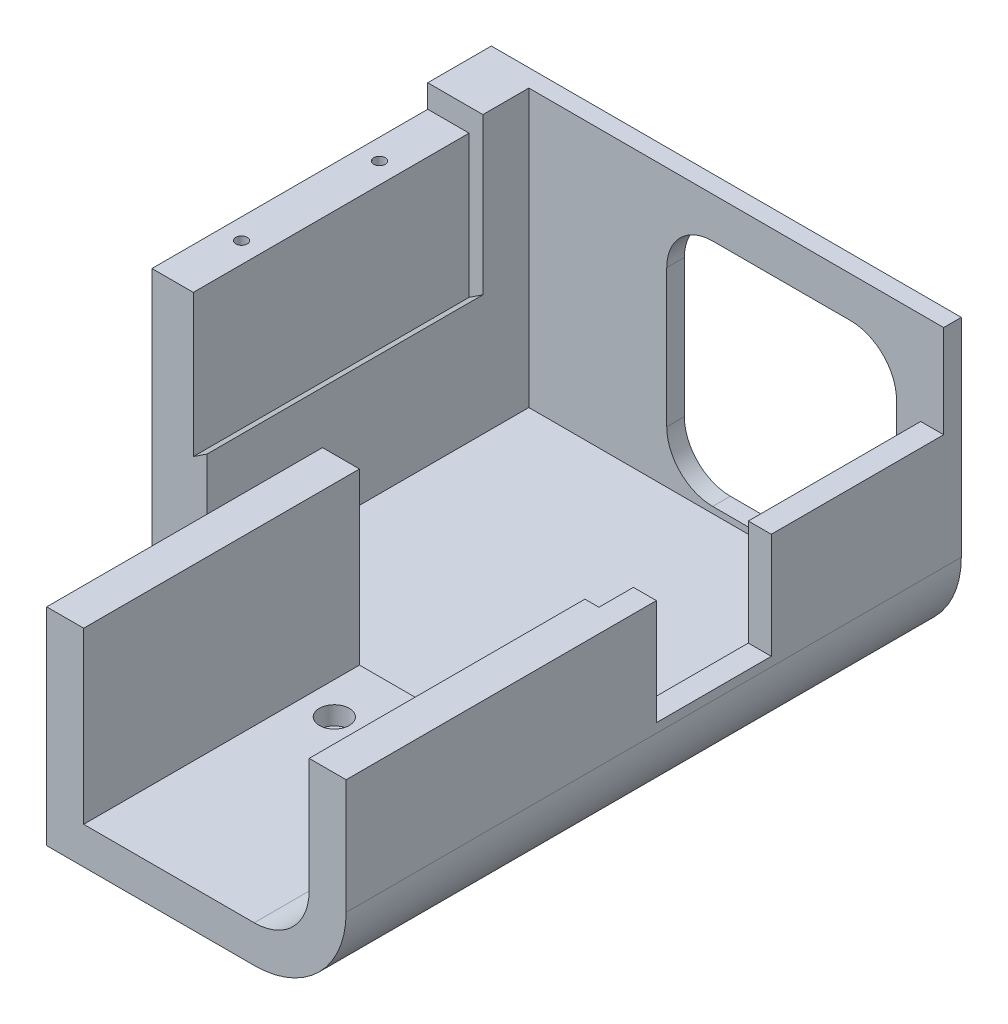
ISO-10303-21;
HEADER;
FILE_DESCRIPTION(('STEP AP214'),'2;1');
FILE_NAME('part.step','',(''),(''),'','','');
FILE_SCHEMA(('AUTOMOTIVE_DESIGN { 1 0 10303 214 1 1 1 1 }'));
ENDSEC;
DATA;
#1=APPLICATION_CONTEXT('core data for automotive mechanical design processes');
#2=APPLICATION_PROTOCOL_DEFINITION('international standard','automotive_design',2000,#1);
#3=PRODUCT_CONTEXT('',#1,'mechanical');
#4=PRODUCT('Part','Part','',(#3));
#5=PRODUCT_RELATED_PRODUCT_CATEGORY('part','',(#4));
#6=PRODUCT_DEFINITION_FORMATION('','',#4);
#7=PRODUCT_DEFINITION_CONTEXT('part definition',#1,'design');
#8=PRODUCT_DEFINITION('design','',#6,#7);
#9=PRODUCT_DEFINITION_SHAPE('','',#8);
#10=(LENGTH_UNIT() NAMED_UNIT(*) SI_UNIT(.MILLI.,.METRE.));
#11=(NAMED_UNIT(*) PLANE_ANGLE_UNIT() SI_UNIT($,.RADIAN.));
#12=(NAMED_UNIT(*) SI_UNIT($,.STERADIAN.) SOLID_ANGLE_UNIT());
#13=UNCERTAINTY_MEASURE_WITH_UNIT(LENGTH_MEASURE(1.E-05),#10,'distance_accuracy_value','');
#14=(GEOMETRIC_REPRESENTATION_CONTEXT(3) GLOBAL_UNCERTAINTY_ASSIGNED_CONTEXT((#13)) GLOBAL_UNIT_ASSIGNED_CONTEXT((#10,
#11,#12)) REPRESENTATION_CONTEXT('',''));
#15=CARTESIAN_POINT('',(0.,0.,0.));
#16=DIRECTION('',(0.,0.,1.));
#17=DIRECTION('',(1.,0.,0.));
#18=AXIS2_PLACEMENT_3D('',#15,#16,#17);
#19=CARTESIAN_POINT('',(85.25,40.,191.268720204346));
#20=DIRECTION('',(0.,-1.,0.));
#21=DIRECTION('',(0.,0.,-1.));
#22=AXIS2_PLACEMENT_3D('',#19,#20,#21);
#23=PLANE('',#22);
#24=DIRECTION('',(0.,0.,-1.));
#25=VECTOR('',#24,1.);
#26=CARTESIAN_POINT('',(85.25,40.,191.268720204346));
#27=LINE('',#26,#25);
#28=CARTESIAN_POINT('',(85.25,40.,37.5));
#29=VERTEX_POINT('',#28);
#30=CARTESIAN_POINT('',(85.25,40.,0.));
#31=VERTEX_POINT('',#30);
#32=EDGE_CURVE('E525',#29,#31,#27,.T.);
#33=ORIENTED_EDGE('',*,*,#32,.F.);
#34=DIRECTION('',(1.,0.,0.));
#35=VECTOR('',#34,1.);
#36=CARTESIAN_POINT('',(51.279424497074,40.,37.5));
#37=LINE('',#36,#35);
#38=CARTESIAN_POINT('',(90.25,40.,37.5));
#39=VERTEX_POINT('',#38);
#40=EDGE_CURVE('E321',#29,#39,#37,.T.);
#41=ORIENTED_EDGE('',*,*,#40,.T.);
#42=DIRECTION('',(0.,0.,-1.));
#43=VECTOR('',#42,1.);
#44=CARTESIAN_POINT('',(90.25,40.,191.268720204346));
#45=LINE('',#44,#43);
#46=CARTESIAN_POINT('',(90.25,40.,0.));
#47=VERTEX_POINT('',#46);
#48=EDGE_CURVE('E568',#39,#47,#45,.T.);
#49=ORIENTED_EDGE('',*,*,#48,.T.);
#50=DIRECTION('',(-1.,0.,0.));
#51=VECTOR('',#50,1.);
#52=CARTESIAN_POINT('',(85.25,40.,0.));
#53=LINE('',#52,#51);
#54=EDGE_CURVE('E522',#47,#31,#53,.T.);
#55=ORIENTED_EDGE('',*,*,#54,.T.);
#56=EDGE_LOOP('',(#33,#41,#49,#55));
#57=FACE_BOUND('',#56,.T.);
#58=ADVANCED_FACE('F43',(#57),#23,.F.);
#59=CARTESIAN_POINT('',(70.25,15.,191.268720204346));
#60=DIRECTION('',(0.,0.,-1.));
#61=DIRECTION('',(-1.,0.,0.));
#62=AXIS2_PLACEMENT_3D('',#59,#60,#61);
#63=CYLINDRICAL_SURFACE('',#62,15.);
#64=CARTESIAN_POINT('',(70.25,15.,70.));
#65=DIRECTION('',(0.,0.,1.));
#66=DIRECTION('',(1.,0.,0.));
#67=AXIS2_PLACEMENT_3D('',#64,#65,#66);
#68=CIRCLE('',#67,15.);
#69=CARTESIAN_POINT('',(85.25,15.,70.));
#70=VERTEX_POINT('',#69);
#71=CARTESIAN_POINT('',(70.25,0.,70.));
#72=VERTEX_POINT('',#71);
#73=EDGE_CURVE('E549',#70,#72,#68,.F.);
#74=ORIENTED_EDGE('',*,*,#73,.F.);
#75=DIRECTION('',(0.,0.,-1.));
#76=VECTOR('',#75,1.);
#77=CARTESIAN_POINT('',(85.25,15.,191.268720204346));
#78=LINE('',#77,#76);
#79=CARTESIAN_POINT('',(85.25,15.,0.));
#80=VERTEX_POINT('',#79);
#81=EDGE_CURVE('E47',#70,#80,#78,.T.);
#82=ORIENTED_EDGE('',*,*,#81,.T.);
#83=CARTESIAN_POINT('',(70.25,15.,0.));
#84=DIRECTION('',(0.,0.,-1.));
#85=DIRECTION('',(1.,0.,0.));
#86=AXIS2_PLACEMENT_3D('',#83,#84,#85);
#87=CIRCLE('',#86,15.);
#88=CARTESIAN_POINT('',(70.25,0.,0.));
#89=VERTEX_POINT('',#88);
#90=EDGE_CURVE('E536',#80,#89,#87,.T.);
#91=ORIENTED_EDGE('',*,*,#90,.T.);
#92=DIRECTION('',(0.,0.,-1.));
#93=VECTOR('',#92,1.);
#94=CARTESIAN_POINT('',(70.25,0.,191.268720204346));
#95=LINE('',#94,#93);
#96=EDGE_CURVE('E535',#72,#89,#95,.T.);
#97=ORIENTED_EDGE('',*,*,#96,.F.);
#98=EDGE_LOOP('',(#74,#82,#91,#97));
#99=FACE_BOUND('',#98,.T.);
#100=ADVANCED_FACE('F605',(#99),#63,.F.);
#101=CARTESIAN_POINT('',(0.,0.,191.268720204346));
#102=DIRECTION('',(0.,-1.,0.));
#103=DIRECTION('',(0.,0.,-1.));
#104=AXIS2_PLACEMENT_3D('',#101,#102,#103);
#105=PLANE('',#104);
#106=DIRECTION('',(-1.,0.,0.));
#107=VECTOR('',#106,1.);
#108=CARTESIAN_POINT('',(0.,0.,70.));
#109=LINE('',#108,#107);
#110=CARTESIAN_POINT('',(25.1,0.,70.));
#111=VERTEX_POINT('',#110);
#112=EDGE_CURVE('E545',#72,#111,#109,.T.);
#113=ORIENTED_EDGE('',*,*,#112,.F.);
#114=ORIENTED_EDGE('',*,*,#96,.T.);
#115=DIRECTION('',(-1.,0.,0.));
#116=VECTOR('',#115,1.);
#117=CARTESIAN_POINT('',(0.,0.,0.));
#118=LINE('',#117,#116);
#119=CARTESIAN_POINT('',(0.,0.,0.));
#120=VERTEX_POINT('',#119);
#121=EDGE_CURVE('E532',#89,#120,#118,.T.);
#122=ORIENTED_EDGE('',*,*,#121,.T.);
#123=DIRECTION('',(0.,0.,-1.));
#124=VECTOR('',#123,1.);
#125=CARTESIAN_POINT('',(0.,0.,191.268720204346));
#126=LINE('',#125,#124);
#127=CARTESIAN_POINT('',(0.,0.,70.));
#128=VERTEX_POINT('',#127);
#129=EDGE_CURVE('E531',#128,#120,#126,.T.);
#130=ORIENTED_EDGE('',*,*,#129,.F.);
#131=EDGE_CURVE('E548',#111,#128,#109,.T.);
#132=ORIENTED_EDGE('',*,*,#131,.F.);
#133=EDGE_LOOP('',(#113,#114,#122,#130,#132));
#134=FACE_BOUND('',#133,.T.);
#135=ADVANCED_FACE('F601',(#134),#105,.F.);
#136=CARTESIAN_POINT('',(0.,60.2,191.268720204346));
#137=DIRECTION('',(-1.,0.,0.));
#138=DIRECTION('',(0.,-1.,0.));
#139=AXIS2_PLACEMENT_3D('',#136,#137,#138);
#140=PLANE('',#139);
#141=DIRECTION('',(0.,-1.,0.));
#142=VECTOR('',#141,1.);
#143=CARTESIAN_POINT('',(0.,26.24,10.));
#144=LINE('',#143,#142);
#145=CARTESIAN_POINT('',(0.,60.2,10.));
#146=VERTEX_POINT('',#145);
#147=CARTESIAN_POINT('',(0.,26.24,9.99999999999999));
#148=VERTEX_POINT('',#147);
#149=EDGE_CURVE('E438',#146,#148,#144,.T.);
#150=ORIENTED_EDGE('',*,*,#149,.T.);
#151=DIRECTION('',(0.,0.,1.));
#152=VECTOR('',#151,1.);
#153=CARTESIAN_POINT('',(0.,26.24,-36.0649913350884));
#154=LINE('',#153,#152);
#155=CARTESIAN_POINT('',(0.,26.24,70.));
#156=VERTEX_POINT('',#155);
#157=EDGE_CURVE('E442',#148,#156,#154,.T.);
#158=ORIENTED_EDGE('',*,*,#157,.T.);
#159=DIRECTION('',(0.,1.,0.));
#160=VECTOR('',#159,1.);
#161=CARTESIAN_POINT('',(0.,60.2,70.));
#162=LINE('',#161,#160);
#163=EDGE_CURVE('E542',#128,#156,#162,.T.);
#164=ORIENTED_EDGE('',*,*,#163,.F.);
#165=ORIENTED_EDGE('',*,*,#129,.T.);
#166=DIRECTION('',(0.,1.,0.));
#167=VECTOR('',#166,1.);
#168=CARTESIAN_POINT('',(0.,60.2,0.));
#169=LINE('',#168,#167);
#170=CARTESIAN_POINT('',(0.,60.2,0.));
#171=VERTEX_POINT('',#170);
#172=EDGE_CURVE('E527',#120,#171,#169,.T.);
#173=ORIENTED_EDGE('',*,*,#172,.T.);
#174=DIRECTION('',(0.,0.,-1.));
#175=VECTOR('',#174,1.);
#176=CARTESIAN_POINT('',(0.,60.2,191.268720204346));
#177=LINE('',#176,#175);
#178=EDGE_CURVE('E530',#146,#171,#177,.T.);
#179=ORIENTED_EDGE('',*,*,#178,.F.);
#180=EDGE_LOOP('',(#150,#158,#164,#165,#173,#179));
#181=FACE_BOUND('',#180,.T.);
#182=ADVANCED_FACE('F596',(#181),#140,.F.);
#183=CARTESIAN_POINT('',(0.,60.2,191.268720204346));
#184=DIRECTION('',(0.,-1.,0.));
#185=DIRECTION('',(0.,0.,-1.));
#186=AXIS2_PLACEMENT_3D('',#183,#184,#185);
#187=PLANE('',#186);
#188=DIRECTION('',(0.,0.,-1.));
#189=VECTOR('',#188,1.);
#190=CARTESIAN_POINT('',(-12.,60.2,191.268720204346));
#191=LINE('',#190,#189);
#192=CARTESIAN_POINT('',(-12.,60.2,10.));
#193=VERTEX_POINT('',#192);
#194=CARTESIAN_POINT('',(-12.,60.2,-3.84));
#195=VERTEX_POINT('',#194);
#196=EDGE_CURVE('E560',#193,#195,#191,.T.);
#197=ORIENTED_EDGE('',*,*,#196,.F.);
#198=DIRECTION('',(1.,0.,0.));
#199=VECTOR('',#198,1.);
#200=CARTESIAN_POINT('',(0.,60.2,10.));
#201=LINE('',#200,#199);
#202=EDGE_CURVE('E441',#193,#146,#201,.T.);
#203=ORIENTED_EDGE('',*,*,#202,.T.);
#204=ORIENTED_EDGE('',*,*,#178,.T.);
#205=DIRECTION('',(-1.,0.,0.));
#206=VECTOR('',#205,1.);
#207=CARTESIAN_POINT('',(90.25,60.2,0.));
#208=LINE('',#207,#206);
#209=CARTESIAN_POINT('',(90.25,60.2,0.));
#210=VERTEX_POINT('',#209);
#211=EDGE_CURVE('E401',#210,#171,#208,.T.);
#212=ORIENTED_EDGE('',*,*,#211,.F.);
#213=DIRECTION('',(0.,0.,1.));
#214=VECTOR('',#213,1.);
#215=CARTESIAN_POINT('',(90.25,60.2,-3.84));
#216=LINE('',#215,#214);
#217=CARTESIAN_POINT('',(90.25,60.2,-3.84));
#218=VERTEX_POINT('',#217);
#219=EDGE_CURVE('E432',#218,#210,#216,.T.);
#220=ORIENTED_EDGE('',*,*,#219,.F.);
#221=DIRECTION('',(-1.,0.,0.));
#222=VECTOR('',#221,1.);
#223=CARTESIAN_POINT('',(90.25,60.2,-3.84));
#224=LINE('',#223,#222);
#225=EDGE_CURVE('E416',#218,#195,#224,.T.);
#226=ORIENTED_EDGE('',*,*,#225,.T.);
#227=EDGE_LOOP('',(#197,#203,#204,#212,#220,#226));
#228=FACE_BOUND('',#227,.T.);
#229=ADVANCED_FACE('F594',(#228),#187,.F.);
#230=CARTESIAN_POINT('',(-12.,60.2,191.268720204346));
#231=DIRECTION('',(1.,0.,0.));
#232=DIRECTION('',(0.,1.,0.));
#233=AXIS2_PLACEMENT_3D('',#230,#231,#232);
#234=PLANE('',#233);
#235=DIRECTION('',(0.,0.,1.));
#236=VECTOR('',#235,1.);
#237=CARTESIAN_POINT('',(-12.,55.2,10.));
#238=LINE('',#237,#236);
#239=CARTESIAN_POINT('',(-12.,55.2,10.));
#240=VERTEX_POINT('',#239);
#241=CARTESIAN_POINT('',(-12.,55.2,70.));
#242=VERTEX_POINT('',#241);
#243=EDGE_CURVE('E299',#240,#242,#238,.T.);
#244=ORIENTED_EDGE('',*,*,#243,.F.);
#245=DIRECTION('',(0.,1.,0.));
#246=VECTOR('',#245,1.);
#247=CARTESIAN_POINT('',(-12.,55.2,10.));
#248=LINE('',#247,#246);
#249=EDGE_CURVE('E303',#240,#193,#248,.T.);
#250=ORIENTED_EDGE('',*,*,#249,.T.);
#251=ORIENTED_EDGE('',*,*,#196,.T.);
#252=DIRECTION('',(0.,-1.,0.));
#253=VECTOR('',#252,1.);
#254=CARTESIAN_POINT('',(-12.,60.2,-3.84));
#255=LINE('',#254,#253);
#256=CARTESIAN_POINT('',(-12.,-5.,-3.84));
#257=VERTEX_POINT('',#256);
#258=EDGE_CURVE('E419',#195,#257,#255,.T.);
#259=ORIENTED_EDGE('',*,*,#258,.T.);
#260=DIRECTION('',(0.,0.,-1.));
#261=VECTOR('',#260,1.);
#262=CARTESIAN_POINT('',(-12.,-5.,191.268720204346));
#263=LINE('',#262,#261);
#264=CARTESIAN_POINT('',(-12.,-5.,70.));
#265=VERTEX_POINT('',#264);
#266=EDGE_CURVE('E562',#265,#257,#263,.T.);
#267=ORIENTED_EDGE('',*,*,#266,.F.);
#268=DIRECTION('',(0.,-1.,0.));
#269=VECTOR('',#268,1.);
#270=CARTESIAN_POINT('',(-12.,60.2,70.));
#271=LINE('',#270,#269);
#272=EDGE_CURVE('E540',#242,#265,#271,.T.);
#273=ORIENTED_EDGE('',*,*,#272,.F.);
#274=EDGE_LOOP('',(#244,#250,#251,#259,#267,#273));
#275=FACE_BOUND('',#274,.T.);
#276=ADVANCED_FACE('F666',(#275),#234,.F.);
#277=CARTESIAN_POINT('',(-12.,-5.,191.268720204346));
#278=DIRECTION('',(0.,1.,0.));
#279=DIRECTION('',(0.,0.,1.));
#280=AXIS2_PLACEMENT_3D('',#277,#278,#279);
#281=PLANE('',#280);
#282=CARTESIAN_POINT('',(40.175,-5.,82.5));
#283=DIRECTION('',(0.,1.,0.));
#284=DIRECTION('',(0.,0.,1.));
#285=AXIS2_PLACEMENT_3D('',#282,#283,#284);
#286=CIRCLE('',#285,1.7);
#287=CARTESIAN_POINT('',(40.175,-5.,84.2));
#288=VERTEX_POINT('',#287);
#289=EDGE_CURVE('E328',#288,#288,#286,.F.);
#290=ORIENTED_EDGE('',*,*,#289,.F.);
#291=EDGE_LOOP('',(#290));
#292=FACE_BOUND('',#291,.T.);
#293=CARTESIAN_POINT('',(55.175,-5.,82.5));
#294=DIRECTION('',(0.,1.,0.));
#295=DIRECTION('',(0.,0.,1.));
#296=AXIS2_PLACEMENT_3D('',#293,#294,#295);
#297=CIRCLE('',#296,1.7);
#298=CARTESIAN_POINT('',(55.175,-5.,84.2));
#299=VERTEX_POINT('',#298);
#300=EDGE_CURVE('E340',#299,#299,#297,.F.);
#301=ORIENTED_EDGE('',*,*,#300,.F.);
#302=EDGE_LOOP('',(#301));
#303=FACE_BOUND('',#302,.T.);
#304=DIRECTION('',(1.,0.,0.));
#305=VECTOR('',#304,1.);
#306=CARTESIAN_POINT('',(-12.,-5.,70.));
#307=LINE('',#306,#305);
#308=CARTESIAN_POINT('',(25.1,-4.99999999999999,70.));
#309=VERTEX_POINT('',#308);
#310=EDGE_CURVE('E52',#265,#309,#307,.T.);
#311=ORIENTED_EDGE('',*,*,#310,.F.);
#312=ORIENTED_EDGE('',*,*,#266,.T.);
#313=DIRECTION('',(1.,0.,0.));
#314=VECTOR('',#313,1.);
#315=CARTESIAN_POINT('',(-12.,-5.,-3.84));
#316=LINE('',#315,#314);
#317=CARTESIAN_POINT('',(70.25,-5.,-3.84));
#318=VERTEX_POINT('',#317);
#319=EDGE_CURVE('E423',#257,#318,#316,.T.);
#320=ORIENTED_EDGE('',*,*,#319,.T.);
#321=DIRECTION('',(0.,0.,-1.));
#322=VECTOR('',#321,1.);
#323=CARTESIAN_POINT('',(70.25,-5.,191.268720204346));
#324=LINE('',#323,#322);
#325=CARTESIAN_POINT('',(70.25,-4.99999999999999,130.));
#326=VERTEX_POINT('',#325);
#327=EDGE_CURVE('E564',#326,#318,#324,.T.);
#328=ORIENTED_EDGE('',*,*,#327,.F.);
#329=DIRECTION('',(1.,0.,0.));
#330=VECTOR('',#329,1.);
#331=CARTESIAN_POINT('',(25.1,-4.99999999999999,130.));
#332=LINE('',#331,#330);
#333=CARTESIAN_POINT('',(25.1,-4.99999999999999,130.));
#334=VERTEX_POINT('',#333);
#335=EDGE_CURVE('E471',#334,#326,#332,.T.);
#336=ORIENTED_EDGE('',*,*,#335,.F.);
#337=DIRECTION('',(0.,0.,-1.));
#338=VECTOR('',#337,1.);
#339=CARTESIAN_POINT('',(25.1,-4.99999999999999,130.));
#340=LINE('',#339,#338);
#341=EDGE_CURVE('E502',#334,#309,#340,.T.);
#342=ORIENTED_EDGE('',*,*,#341,.T.);
#343=EDGE_LOOP('',(#311,#312,#320,#328,#336,#342));
#344=FACE_BOUND('',#343,.T.);
#345=ADVANCED_FACE('F660',(#292,#303,#344),#281,.F.);
#346=CARTESIAN_POINT('',(70.25,15.,191.268720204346));
#347=DIRECTION('',(0.,0.,-1.));
#348=DIRECTION('',(-1.,0.,0.));
#349=AXIS2_PLACEMENT_3D('',#346,#347,#348);
#350=CYLINDRICAL_SURFACE('',#349,20.);
#351=DIRECTION('',(0.,0.,-1.));
#352=VECTOR('',#351,1.);
#353=CARTESIAN_POINT('',(90.25,15.,191.268720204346));
#354=LINE('',#353,#352);
#355=CARTESIAN_POINT('',(90.25,15.,130.));
#356=VERTEX_POINT('',#355);
#357=CARTESIAN_POINT('',(90.25,15.,-3.84));
#358=VERTEX_POINT('',#357);
#359=EDGE_CURVE('E566',#356,#358,#354,.T.);
#360=ORIENTED_EDGE('',*,*,#359,.F.);
#361=CARTESIAN_POINT('',(70.25,15.,130.));
#362=DIRECTION('',(0.,0.,1.));
#363=DIRECTION('',(1.,0.,0.));
#364=AXIS2_PLACEMENT_3D('',#361,#362,#363);
#365=CIRCLE('',#364,20.);
#366=EDGE_CURVE('E474',#326,#356,#365,.T.);
#367=ORIENTED_EDGE('',*,*,#366,.F.);
#368=ORIENTED_EDGE('',*,*,#327,.T.);
#369=CARTESIAN_POINT('',(70.25,15.,-3.84));
#370=DIRECTION('',(0.,0.,1.));
#371=DIRECTION('',(1.,0.,0.));
#372=AXIS2_PLACEMENT_3D('',#369,#370,#371);
#373=CIRCLE('',#372,20.);
#374=EDGE_CURVE('E426',#318,#358,#373,.T.);
#375=ORIENTED_EDGE('',*,*,#374,.T.);
#376=EDGE_LOOP('',(#360,#367,#368,#375));
#377=FACE_BOUND('',#376,.T.);
#378=ADVANCED_FACE('F656',(#377),#350,.T.);
#379=CARTESIAN_POINT('',(90.25,15.,191.268720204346));
#380=DIRECTION('',(-1.,0.,0.));
#381=DIRECTION('',(0.,0.,1.));
#382=AXIS2_PLACEMENT_3D('',#379,#380,#381);
#383=PLANE('',#382);
#384=ORIENTED_EDGE('',*,*,#48,.F.);
#385=DIRECTION('',(0.,1.,0.));
#386=VECTOR('',#385,1.);
#387=CARTESIAN_POINT('',(90.25,17.,37.5));
#388=LINE('',#387,#386);
#389=CARTESIAN_POINT('',(90.25,17.,37.5));
#390=VERTEX_POINT('',#389);
#391=EDGE_CURVE('E306',#390,#39,#388,.T.);
#392=ORIENTED_EDGE('',*,*,#391,.F.);
#393=DIRECTION('',(0.,0.,-1.));
#394=VECTOR('',#393,1.);
#395=CARTESIAN_POINT('',(90.25,17.,62.5));
#396=LINE('',#395,#394);
#397=CARTESIAN_POINT('',(90.25,17.,62.5));
#398=VERTEX_POINT('',#397);
#399=EDGE_CURVE('E318',#398,#390,#396,.T.);
#400=ORIENTED_EDGE('',*,*,#399,.F.);
#401=DIRECTION('',(0.,-1.,0.));
#402=VECTOR('',#401,1.);
#403=CARTESIAN_POINT('',(90.25,17.,62.5));
#404=LINE('',#403,#402);
#405=CARTESIAN_POINT('',(90.25,40.,62.5));
#406=VERTEX_POINT('',#405);
#407=EDGE_CURVE('E316',#406,#398,#404,.T.);
#408=ORIENTED_EDGE('',*,*,#407,.F.);
#409=CARTESIAN_POINT('',(90.25,40.,130.));
#410=VERTEX_POINT('',#409);
#411=EDGE_CURVE('E526',#410,#406,#45,.T.);
#412=ORIENTED_EDGE('',*,*,#411,.F.);
#413=DIRECTION('',(0.,1.,0.));
#414=VECTOR('',#413,1.);
#415=CARTESIAN_POINT('',(90.25,15.,130.));
#416=LINE('',#415,#414);
#417=EDGE_CURVE('E477',#356,#410,#416,.T.);
#418=ORIENTED_EDGE('',*,*,#417,.F.);
#419=ORIENTED_EDGE('',*,*,#359,.T.);
#420=DIRECTION('',(0.,1.,0.));
#421=VECTOR('',#420,1.);
#422=CARTESIAN_POINT('',(90.25,15.,-3.84));
#423=LINE('',#422,#421);
#424=EDGE_CURVE('E429',#358,#218,#423,.T.);
#425=ORIENTED_EDGE('',*,*,#424,.T.);
#426=ORIENTED_EDGE('',*,*,#219,.T.);
#427=DIRECTION('',(0.,1.,0.));
#428=VECTOR('',#427,1.);
#429=CARTESIAN_POINT('',(90.25,15.,0.));
#430=LINE('',#429,#428);
#431=EDGE_CURVE('E420',#47,#210,#430,.T.);
#432=ORIENTED_EDGE('',*,*,#431,.F.);
#433=EDGE_LOOP('',(#384,#392,#400,#408,#412,#418,#419,#425,#426,#432));
#434=FACE_BOUND('',#433,.T.);
#435=ADVANCED_FACE('F588',(#434),#383,.F.);
#436=ORIENTED_EDGE('',*,*,#411,.T.);
#437=DIRECTION('',(1.,0.,0.));
#438=VECTOR('',#437,1.);
#439=CARTESIAN_POINT('',(51.279424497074,40.,62.5));
#440=LINE('',#439,#438);
#441=CARTESIAN_POINT('',(85.25,40.,62.5));
#442=VERTEX_POINT('',#441);
#443=EDGE_CURVE('E324',#442,#406,#440,.T.);
#444=ORIENTED_EDGE('',*,*,#443,.F.);
#445=CARTESIAN_POINT('',(85.25,40.,70.));
#446=VERTEX_POINT('',#445);
#447=EDGE_CURVE('E521',#446,#442,#27,.T.);
#448=ORIENTED_EDGE('',*,*,#447,.F.);
#449=DIRECTION('',(-1.,0.,0.));
#450=VECTOR('',#449,1.);
#451=CARTESIAN_POINT('',(82.2,40.,70.));
#452=LINE('',#451,#450);
#453=CARTESIAN_POINT('',(82.2,40.,70.));
#454=VERTEX_POINT('',#453);
#455=EDGE_CURVE('E494',#446,#454,#452,.T.);
#456=ORIENTED_EDGE('',*,*,#455,.T.);
#457=DIRECTION('',(0.,0.,-1.));
#458=VECTOR('',#457,1.);
#459=CARTESIAN_POINT('',(82.2,40.,130.));
#460=LINE('',#459,#458);
#461=CARTESIAN_POINT('',(82.2,40.,130.));
#462=VERTEX_POINT('',#461);
#463=EDGE_CURVE('E499',#462,#454,#460,.T.);
#464=ORIENTED_EDGE('',*,*,#463,.F.);
#465=DIRECTION('',(-1.,0.,0.));
#466=VECTOR('',#465,1.);
#467=CARTESIAN_POINT('',(82.2,40.,130.));
#468=LINE('',#467,#466);
#469=EDGE_CURVE('E480',#410,#462,#468,.T.);
#470=ORIENTED_EDGE('',*,*,#469,.F.);
#471=EDGE_LOOP('',(#436,#444,#448,#456,#464,#470));
#472=FACE_BOUND('',#471,.T.);
#473=ADVANCED_FACE('F613',(#472),#23,.F.);
#474=CARTESIAN_POINT('',(85.25,15.,191.268720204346));
#475=DIRECTION('',(1.,0.,0.));
#476=DIRECTION('',(0.,0.,-1.));
#477=AXIS2_PLACEMENT_3D('',#474,#475,#476);
#478=PLANE('',#477);
#479=DIRECTION('',(0.,0.,1.));
#480=VECTOR('',#479,1.);
#481=CARTESIAN_POINT('',(85.25,17.,62.5));
#482=LINE('',#481,#480);
#483=CARTESIAN_POINT('',(85.25,17.,37.5));
#484=VERTEX_POINT('',#483);
#485=CARTESIAN_POINT('',(85.25,17.,62.5));
#486=VERTEX_POINT('',#485);
#487=EDGE_CURVE('E309',#484,#486,#482,.T.);
#488=ORIENTED_EDGE('',*,*,#487,.F.);
#489=DIRECTION('',(0.,-1.,0.));
#490=VECTOR('',#489,1.);
#491=CARTESIAN_POINT('',(85.25,17.,37.5));
#492=LINE('',#491,#490);
#493=EDGE_CURVE('E312',#29,#484,#492,.T.);
#494=ORIENTED_EDGE('',*,*,#493,.F.);
#495=ORIENTED_EDGE('',*,*,#32,.T.);
#496=DIRECTION('',(0.,-1.,0.));
#497=VECTOR('',#496,1.);
#498=CARTESIAN_POINT('',(85.25,15.,0.));
#499=LINE('',#498,#497);
#500=EDGE_CURVE('E517',#31,#80,#499,.T.);
#501=ORIENTED_EDGE('',*,*,#500,.T.);
#502=ORIENTED_EDGE('',*,*,#81,.F.);
#503=DIRECTION('',(0.,-1.,0.));
#504=VECTOR('',#503,1.);
#505=CARTESIAN_POINT('',(85.25,15.,70.));
#506=LINE('',#505,#504);
#507=EDGE_CURVE('E520',#446,#70,#506,.T.);
#508=ORIENTED_EDGE('',*,*,#507,.F.);
#509=ORIENTED_EDGE('',*,*,#447,.T.);
#510=DIRECTION('',(0.,1.,0.));
#511=VECTOR('',#510,1.);
#512=CARTESIAN_POINT('',(85.25,17.,62.5));
#513=LINE('',#512,#511);
#514=EDGE_CURVE('E307',#486,#442,#513,.T.);
#515=ORIENTED_EDGE('',*,*,#514,.F.);
#516=EDGE_LOOP('',(#488,#494,#495,#501,#502,#508,#509,#515));
#517=FACE_BOUND('',#516,.T.);
#518=ADVANCED_FACE('F578',(#517),#478,.F.);
#519=CARTESIAN_POINT('',(0.,0.,70.));
#520=DIRECTION('',(0.,0.,1.));
#521=DIRECTION('',(1.,0.,0.));
#522=AXIS2_PLACEMENT_3D('',#519,#520,#521);
#523=PLANE('',#522);
#524=DIRECTION('',(1.,0.,0.));
#525=VECTOR('',#524,1.);
#526=CARTESIAN_POINT('',(-3.,55.2,70.));
#527=LINE('',#526,#525);
#528=CARTESIAN_POINT('',(-3.,55.2,70.));
#529=VERTEX_POINT('',#528);
#530=EDGE_CURVE('E301',#242,#529,#527,.T.);
#531=ORIENTED_EDGE('',*,*,#530,.F.);
#532=ORIENTED_EDGE('',*,*,#272,.T.);
#533=ORIENTED_EDGE('',*,*,#310,.T.);
#534=DIRECTION('',(0.,-1.,0.));
#535=VECTOR('',#534,1.);
#536=CARTESIAN_POINT('',(25.1,40.,70.));
#537=LINE('',#536,#535);
#538=EDGE_CURVE('E12',#111,#309,#537,.T.);
#539=ORIENTED_EDGE('',*,*,#538,.F.);
#540=ORIENTED_EDGE('',*,*,#131,.T.);
#541=ORIENTED_EDGE('',*,*,#163,.T.);
#542=DIRECTION('',(0.834609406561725,0.550842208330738,0.));
#543=VECTOR('',#542,1.);
#544=CARTESIAN_POINT('',(-3.,24.26,70.));
#545=LINE('',#544,#543);
#546=CARTESIAN_POINT('',(-3.,24.26,70.));
#547=VERTEX_POINT('',#546);
#548=EDGE_CURVE('E450',#547,#156,#545,.T.);
#549=ORIENTED_EDGE('',*,*,#548,.F.);
#550=DIRECTION('',(0.,-1.,0.));
#551=VECTOR('',#550,1.);
#552=CARTESIAN_POINT('',(-3.,60.2,70.));
#553=LINE('',#552,#551);
#554=EDGE_CURVE('E437',#529,#547,#553,.T.);
#555=ORIENTED_EDGE('',*,*,#554,.F.);
#556=EDGE_LOOP('',(#531,#532,#533,#539,#540,#541,#549,#555));
#557=FACE_BOUND('',#556,.T.);
#558=ADVANCED_FACE('F45',(#557),#523,.T.);
#559=CARTESIAN_POINT('',(70.25,15.,70.));
#560=DIRECTION('',(0.,0.,1.));
#561=DIRECTION('',(1.,0.,0.));
#562=AXIS2_PLACEMENT_3D('',#559,#560,#561);
#563=PLANE('',#562);
#564=ORIENTED_EDGE('',*,*,#455,.F.);
#565=ORIENTED_EDGE('',*,*,#507,.T.);
#566=ORIENTED_EDGE('',*,*,#73,.T.);
#567=ORIENTED_EDGE('',*,*,#112,.T.);
#568=CARTESIAN_POINT('',(25.1,40.,70.));
#569=VERTEX_POINT('',#568);
#570=EDGE_CURVE('E54',#569,#111,#537,.T.);
#571=ORIENTED_EDGE('',*,*,#570,.F.);
#572=DIRECTION('',(-1.,0.,0.));
#573=VECTOR('',#572,1.);
#574=CARTESIAN_POINT('',(25.1,40.,70.));
#575=LINE('',#574,#573);
#576=CARTESIAN_POINT('',(33.15,40.,70.));
#577=VERTEX_POINT('',#576);
#578=EDGE_CURVE('E491',#577,#569,#575,.T.);
#579=ORIENTED_EDGE('',*,*,#578,.F.);
#580=DIRECTION('',(0.,1.,0.));
#581=VECTOR('',#580,1.);
#582=CARTESIAN_POINT('',(33.15,40.,70.));
#583=LINE('',#582,#581);
#584=CARTESIAN_POINT('',(33.15,3.05,70.));
#585=VERTEX_POINT('',#584);
#586=EDGE_CURVE('E489',#585,#577,#583,.T.);
#587=ORIENTED_EDGE('',*,*,#586,.F.);
#588=DIRECTION('',(-1.,0.,0.));
#589=VECTOR('',#588,1.);
#590=CARTESIAN_POINT('',(33.15,3.05,70.));
#591=LINE('',#590,#589);
#592=CARTESIAN_POINT('',(70.25,3.05,70.));
#593=VERTEX_POINT('',#592);
#594=EDGE_CURVE('E487',#593,#585,#591,.T.);
#595=ORIENTED_EDGE('',*,*,#594,.F.);
#596=CARTESIAN_POINT('',(70.25,15.,70.));
#597=DIRECTION('',(0.,0.,-1.));
#598=DIRECTION('',(1.,0.,0.));
#599=AXIS2_PLACEMENT_3D('',#596,#597,#598);
#600=CIRCLE('',#599,11.95);
#601=CARTESIAN_POINT('',(82.2,15.,70.));
#602=VERTEX_POINT('',#601);
#603=EDGE_CURVE('E458',#602,#593,#600,.T.);
#604=ORIENTED_EDGE('',*,*,#603,.F.);
#605=DIRECTION('',(0.,-1.,0.));
#606=VECTOR('',#605,1.);
#607=CARTESIAN_POINT('',(82.2,15.,70.));
#608=LINE('',#607,#606);
#609=EDGE_CURVE('E463',#454,#602,#608,.T.);
#610=ORIENTED_EDGE('',*,*,#609,.F.);
#611=EDGE_LOOP('',(#564,#565,#566,#567,#571,#579,#587,#595,#604,#610));
#612=FACE_BOUND('',#611,.T.);
#613=ADVANCED_FACE('F609',(#612),#563,.F.);
#614=CARTESIAN_POINT('',(70.25,15.,130.));
#615=DIRECTION('',(0.,0.,-1.));
#616=DIRECTION('',(-1.,0.,0.));
#617=AXIS2_PLACEMENT_3D('',#614,#615,#616);
#618=CYLINDRICAL_SURFACE('',#617,11.95);
#619=ORIENTED_EDGE('',*,*,#603,.T.);
#620=DIRECTION('',(0.,0.,-1.));
#621=VECTOR('',#620,1.);
#622=CARTESIAN_POINT('',(70.25,3.05,130.));
#623=LINE('',#622,#621);
#624=CARTESIAN_POINT('',(70.25,3.05,130.));
#625=VERTEX_POINT('',#624);
#626=EDGE_CURVE('E514',#625,#593,#623,.T.);
#627=ORIENTED_EDGE('',*,*,#626,.F.);
#628=CARTESIAN_POINT('',(70.25,15.,130.));
#629=DIRECTION('',(0.,0.,-1.));
#630=DIRECTION('',(1.,0.,0.));
#631=AXIS2_PLACEMENT_3D('',#628,#629,#630);
#632=CIRCLE('',#631,11.95);
#633=CARTESIAN_POINT('',(82.2,15.,130.));
#634=VERTEX_POINT('',#633);
#635=EDGE_CURVE('E459',#634,#625,#632,.T.);
#636=ORIENTED_EDGE('',*,*,#635,.F.);
#637=DIRECTION('',(0.,0.,-1.));
#638=VECTOR('',#637,1.);
#639=CARTESIAN_POINT('',(82.2,15.,130.));
#640=LINE('',#639,#638);
#641=EDGE_CURVE('E484',#634,#602,#640,.T.);
#642=ORIENTED_EDGE('',*,*,#641,.T.);
#643=EDGE_LOOP('',(#619,#627,#636,#642));
#644=FACE_BOUND('',#643,.T.);
#645=ADVANCED_FACE('F1017',(#644),#618,.F.);
#646=CARTESIAN_POINT('',(33.15,3.05,130.));
#647=DIRECTION('',(0.,-1.,0.));
#648=DIRECTION('',(1.,0.,0.));
#649=AXIS2_PLACEMENT_3D('',#646,#647,#648);
#650=PLANE('',#649);
#651=CARTESIAN_POINT('',(40.175,3.05,82.5));
#652=DIRECTION('',(0.,1.,0.));
#653=DIRECTION('',(0.,0.,1.));
#654=AXIS2_PLACEMENT_3D('',#651,#652,#653);
#655=CIRCLE('',#654,3.25);
#656=CARTESIAN_POINT('',(40.175,3.05,85.75));
#657=VERTEX_POINT('',#656);
#658=EDGE_CURVE('E314',#657,#657,#655,.T.);
#659=ORIENTED_EDGE('',*,*,#658,.F.);
#660=EDGE_LOOP('',(#659));
#661=FACE_BOUND('',#660,.T.);
#662=CARTESIAN_POINT('',(55.175,3.05,82.5));
#663=DIRECTION('',(0.,1.,0.));
#664=DIRECTION('',(0.,0.,1.));
#665=AXIS2_PLACEMENT_3D('',#662,#663,#664);
#666=CIRCLE('',#665,3.25);
#667=CARTESIAN_POINT('',(55.175,3.05,85.75));
#668=VERTEX_POINT('',#667);
#669=EDGE_CURVE('E331',#668,#668,#666,.T.);
#670=ORIENTED_EDGE('',*,*,#669,.F.);
#671=EDGE_LOOP('',(#670));
#672=FACE_BOUND('',#671,.T.);
#673=ORIENTED_EDGE('',*,*,#594,.T.);
#674=DIRECTION('',(0.,0.,-1.));
#675=VECTOR('',#674,1.);
#676=CARTESIAN_POINT('',(33.15,3.05,130.));
#677=LINE('',#676,#675);
#678=CARTESIAN_POINT('',(33.15,3.05,130.));
#679=VERTEX_POINT('',#678);
#680=EDGE_CURVE('E511',#679,#585,#677,.T.);
#681=ORIENTED_EDGE('',*,*,#680,.F.);
#682=DIRECTION('',(-1.,0.,0.));
#683=VECTOR('',#682,1.);
#684=CARTESIAN_POINT('',(33.15,3.05,130.));
#685=LINE('',#684,#683);
#686=EDGE_CURVE('E462',#625,#679,#685,.T.);
#687=ORIENTED_EDGE('',*,*,#686,.F.);
#688=ORIENTED_EDGE('',*,*,#626,.T.);
#689=EDGE_LOOP('',(#673,#681,#687,#688));
#690=FACE_BOUND('',#689,.T.);
#691=ADVANCED_FACE('F1023',(#661,#672,#690),#650,.F.);
#692=CARTESIAN_POINT('',(33.15,40.,130.));
#693=DIRECTION('',(-1.,0.,0.));
#694=DIRECTION('',(0.,-1.,0.));
#695=AXIS2_PLACEMENT_3D('',#692,#693,#694);
#696=PLANE('',#695);
#697=ORIENTED_EDGE('',*,*,#586,.T.);
#698=DIRECTION('',(0.,0.,-1.));
#699=VECTOR('',#698,1.);
#700=CARTESIAN_POINT('',(33.15,40.,130.));
#701=LINE('',#700,#699);
#702=CARTESIAN_POINT('',(33.15,40.,130.));
#703=VERTEX_POINT('',#702);
#704=EDGE_CURVE('E508',#703,#577,#701,.T.);
#705=ORIENTED_EDGE('',*,*,#704,.F.);
#706=DIRECTION('',(0.,1.,0.));
#707=VECTOR('',#706,1.);
#708=CARTESIAN_POINT('',(33.15,40.,130.));
#709=LINE('',#708,#707);
#710=EDGE_CURVE('E465',#679,#703,#709,.T.);
#711=ORIENTED_EDGE('',*,*,#710,.F.);
#712=ORIENTED_EDGE('',*,*,#680,.T.);
#713=EDGE_LOOP('',(#697,#705,#711,#712));
#714=FACE_BOUND('',#713,.T.);
#715=ADVANCED_FACE('F1031',(#714),#696,.F.);
#716=CARTESIAN_POINT('',(25.1,40.,130.));
#717=DIRECTION('',(0.,-1.,0.));
#718=DIRECTION('',(0.,0.,-1.));
#719=AXIS2_PLACEMENT_3D('',#716,#717,#718);
#720=PLANE('',#719);
#721=ORIENTED_EDGE('',*,*,#578,.T.);
#722=DIRECTION('',(0.,0.,-1.));
#723=VECTOR('',#722,1.);
#724=CARTESIAN_POINT('',(25.1,40.,130.));
#725=LINE('',#724,#723);
#726=CARTESIAN_POINT('',(25.1,40.,130.));
#727=VERTEX_POINT('',#726);
#728=EDGE_CURVE('E505',#727,#569,#725,.T.);
#729=ORIENTED_EDGE('',*,*,#728,.F.);
#730=DIRECTION('',(-1.,0.,0.));
#731=VECTOR('',#730,1.);
#732=CARTESIAN_POINT('',(25.1,40.,130.));
#733=LINE('',#732,#731);
#734=EDGE_CURVE('E467',#703,#727,#733,.T.);
#735=ORIENTED_EDGE('',*,*,#734,.F.);
#736=ORIENTED_EDGE('',*,*,#704,.T.);
#737=EDGE_LOOP('',(#721,#729,#735,#736));
#738=FACE_BOUND('',#737,.T.);
#739=ADVANCED_FACE('F1038',(#738),#720,.F.);
#740=CARTESIAN_POINT('',(25.1,40.,130.));
#741=DIRECTION('',(1.,0.,0.));
#742=DIRECTION('',(0.,1.,0.));
#743=AXIS2_PLACEMENT_3D('',#740,#741,#742);
#744=PLANE('',#743);
#745=ORIENTED_EDGE('',*,*,#570,.T.);
#746=ORIENTED_EDGE('',*,*,#538,.T.);
#747=ORIENTED_EDGE('',*,*,#341,.F.);
#748=DIRECTION('',(0.,-1.,0.));
#749=VECTOR('',#748,1.);
#750=CARTESIAN_POINT('',(25.1,40.,130.));
#751=LINE('',#750,#749);
#752=EDGE_CURVE('E469',#727,#334,#751,.T.);
#753=ORIENTED_EDGE('',*,*,#752,.F.);
#754=ORIENTED_EDGE('',*,*,#728,.T.);
#755=EDGE_LOOP('',(#745,#746,#747,#753,#754));
#756=FACE_BOUND('',#755,.T.);
#757=ADVANCED_FACE('F1046',(#756),#744,.F.);
#758=CARTESIAN_POINT('',(82.2,15.,130.));
#759=DIRECTION('',(1.,0.,0.));
#760=DIRECTION('',(0.,0.,-1.));
#761=AXIS2_PLACEMENT_3D('',#758,#759,#760);
#762=PLANE('',#761);
#763=ORIENTED_EDGE('',*,*,#609,.T.);
#764=ORIENTED_EDGE('',*,*,#641,.F.);
#765=DIRECTION('',(0.,-1.,0.));
#766=VECTOR('',#765,1.);
#767=CARTESIAN_POINT('',(82.2,15.,130.));
#768=LINE('',#767,#766);
#769=EDGE_CURVE('E482',#462,#634,#768,.T.);
#770=ORIENTED_EDGE('',*,*,#769,.F.);
#771=ORIENTED_EDGE('',*,*,#463,.T.);
#772=EDGE_LOOP('',(#763,#764,#770,#771));
#773=FACE_BOUND('',#772,.T.);
#774=ADVANCED_FACE('F618',(#773),#762,.F.);
#775=CARTESIAN_POINT('',(70.25,15.,130.));
#776=DIRECTION('',(0.,0.,1.));
#777=DIRECTION('',(1.,0.,0.));
#778=AXIS2_PLACEMENT_3D('',#775,#776,#777);
#779=PLANE('',#778);
#780=ORIENTED_EDGE('',*,*,#635,.T.);
#781=ORIENTED_EDGE('',*,*,#686,.T.);
#782=ORIENTED_EDGE('',*,*,#710,.T.);
#783=ORIENTED_EDGE('',*,*,#734,.T.);
#784=ORIENTED_EDGE('',*,*,#752,.T.);
#785=ORIENTED_EDGE('',*,*,#335,.T.);
#786=ORIENTED_EDGE('',*,*,#366,.T.);
#787=ORIENTED_EDGE('',*,*,#417,.T.);
#788=ORIENTED_EDGE('',*,*,#469,.T.);
#789=ORIENTED_EDGE('',*,*,#769,.T.);
#790=EDGE_LOOP('',(#780,#781,#782,#783,#784,#785,#786,#787,#788,#789));
#791=FACE_BOUND('',#790,.T.);
#792=ADVANCED_FACE('F622',(#791),#779,.T.);
#793=CARTESIAN_POINT('',(-3.,60.2,-36.0649913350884));
#794=DIRECTION('',(-1.,0.,0.));
#795=DIRECTION('',(0.,-1.,0.));
#796=AXIS2_PLACEMENT_3D('',#793,#794,#795);
#797=PLANE('',#796);
#798=DIRECTION('',(0.,1.,0.));
#799=VECTOR('',#798,1.);
#800=CARTESIAN_POINT('',(-3.,60.2,10.));
#801=LINE('',#800,#799);
#802=CARTESIAN_POINT('',(-3.,24.26,10.));
#803=VERTEX_POINT('',#802);
#804=CARTESIAN_POINT('',(-3.,55.2,10.));
#805=VERTEX_POINT('',#804);
#806=EDGE_CURVE('E445',#803,#805,#801,.T.);
#807=ORIENTED_EDGE('',*,*,#806,.T.);
#808=DIRECTION('',(0.,0.,-1.));
#809=VECTOR('',#808,1.);
#810=CARTESIAN_POINT('',(-3.,55.2,10.));
#811=LINE('',#810,#809);
#812=EDGE_CURVE('E61',#529,#805,#811,.T.);
#813=ORIENTED_EDGE('',*,*,#812,.F.);
#814=ORIENTED_EDGE('',*,*,#554,.T.);
#815=DIRECTION('',(0.,0.,1.));
#816=VECTOR('',#815,1.);
#817=CARTESIAN_POINT('',(-3.,24.26,-36.0649913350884));
#818=LINE('',#817,#816);
#819=EDGE_CURVE('E452',#803,#547,#818,.T.);
#820=ORIENTED_EDGE('',*,*,#819,.F.);
#821=EDGE_LOOP('',(#807,#813,#814,#820));
#822=FACE_BOUND('',#821,.T.);
#823=ADVANCED_FACE('F994',(#822),#797,.F.);
#824=CARTESIAN_POINT('',(-3.,24.26,-36.0649913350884));
#825=DIRECTION('',(0.550842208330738,-0.834609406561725,0.));
#826=DIRECTION('',(0.834609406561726,0.550842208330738,0.));
#827=AXIS2_PLACEMENT_3D('',#824,#825,#826);
#828=PLANE('',#827);
#829=DIRECTION('',(-0.834609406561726,-0.550842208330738,0.));
#830=VECTOR('',#829,1.);
#831=CARTESIAN_POINT('',(-3.,24.26,10.));
#832=LINE('',#831,#830);
#833=EDGE_CURVE('E448',#148,#803,#832,.T.);
#834=ORIENTED_EDGE('',*,*,#833,.T.);
#835=ORIENTED_EDGE('',*,*,#819,.T.);
#836=ORIENTED_EDGE('',*,*,#548,.T.);
#837=ORIENTED_EDGE('',*,*,#157,.F.);
#838=EDGE_LOOP('',(#834,#835,#836,#837));
#839=FACE_BOUND('',#838,.T.);
#840=ADVANCED_FACE('F983',(#839),#828,.F.);
#841=CARTESIAN_POINT('',(70.25,15.,10.));
#842=DIRECTION('',(0.,0.,1.));
#843=DIRECTION('',(1.,0.,0.));
#844=AXIS2_PLACEMENT_3D('',#841,#842,#843);
#845=PLANE('',#844);
#846=ORIENTED_EDGE('',*,*,#806,.F.);
#847=ORIENTED_EDGE('',*,*,#833,.F.);
#848=ORIENTED_EDGE('',*,*,#149,.F.);
#849=ORIENTED_EDGE('',*,*,#202,.F.);
#850=ORIENTED_EDGE('',*,*,#249,.F.);
#851=DIRECTION('',(-1.,0.,0.));
#852=VECTOR('',#851,1.);
#853=CARTESIAN_POINT('',(-3.,55.2,10.));
#854=LINE('',#853,#852);
#855=EDGE_CURVE('E297',#805,#240,#854,.T.);
#856=ORIENTED_EDGE('',*,*,#855,.F.);
#857=EDGE_LOOP('',(#846,#847,#848,#849,#850,#856));
#858=FACE_BOUND('',#857,.T.);
#859=ADVANCED_FACE('F716',(#858),#845,.T.);
#860=CARTESIAN_POINT('',(70.25,15.,0.));
#861=DIRECTION('',(0.,0.,1.));
#862=DIRECTION('',(1.,0.,0.));
#863=AXIS2_PLACEMENT_3D('',#860,#861,#862);
#864=PLANE('',#863);
#865=CARTESIAN_POINT('',(70.,41.37,0.));
#866=DIRECTION('',(0.,0.,1.));
#867=DIRECTION('',(1.,0.,0.));
#868=AXIS2_PLACEMENT_3D('',#865,#866,#867);
#869=CIRCLE('',#868,10.);
#870=CARTESIAN_POINT('',(80.,41.37,0.));
#871=VERTEX_POINT('',#870);
#872=CARTESIAN_POINT('',(70.,51.37,0.));
#873=VERTEX_POINT('',#872);
#874=EDGE_CURVE('E343',#871,#873,#869,.T.);
#875=ORIENTED_EDGE('',*,*,#874,.F.);
#876=DIRECTION('',(0.,1.,0.));
#877=VECTOR('',#876,1.);
#878=CARTESIAN_POINT('',(80.,11.37,0.));
#879=LINE('',#878,#877);
#880=CARTESIAN_POINT('',(80.,11.37,0.));
#881=VERTEX_POINT('',#880);
#882=EDGE_CURVE('E356',#881,#871,#879,.T.);
#883=ORIENTED_EDGE('',*,*,#882,.F.);
#884=CARTESIAN_POINT('',(70.,11.37,0.));
#885=DIRECTION('',(0.,0.,1.));
#886=DIRECTION('',(1.,0.,0.));
#887=AXIS2_PLACEMENT_3D('',#884,#885,#886);
#888=CIRCLE('',#887,10.);
#889=CARTESIAN_POINT('',(70.,1.37,0.));
#890=VERTEX_POINT('',#889);
#891=EDGE_CURVE('E394',#890,#881,#888,.T.);
#892=ORIENTED_EDGE('',*,*,#891,.F.);
#893=DIRECTION('',(1.,0.,0.));
#894=VECTOR('',#893,1.);
#895=CARTESIAN_POINT('',(40.,1.37,0.));
#896=LINE('',#895,#894);
#897=CARTESIAN_POINT('',(40.,1.37,0.));
#898=VERTEX_POINT('',#897);
#899=EDGE_CURVE('E391',#898,#890,#896,.T.);
#900=ORIENTED_EDGE('',*,*,#899,.F.);
#901=CARTESIAN_POINT('',(40.,11.37,0.));
#902=DIRECTION('',(0.,0.,1.));
#903=DIRECTION('',(1.,0.,0.));
#904=AXIS2_PLACEMENT_3D('',#901,#902,#903);
#905=CIRCLE('',#904,10.);
#906=CARTESIAN_POINT('',(30.,11.37,0.));
#907=VERTEX_POINT('',#906);
#908=EDGE_CURVE('E388',#907,#898,#905,.T.);
#909=ORIENTED_EDGE('',*,*,#908,.F.);
#910=DIRECTION('',(0.,-1.,0.));
#911=VECTOR('',#910,1.);
#912=CARTESIAN_POINT('',(30.,41.37,0.));
#913=LINE('',#912,#911);
#914=CARTESIAN_POINT('',(30.,41.37,0.));
#915=VERTEX_POINT('',#914);
#916=EDGE_CURVE('E385',#915,#907,#913,.T.);
#917=ORIENTED_EDGE('',*,*,#916,.F.);
#918=CARTESIAN_POINT('',(40.,41.37,0.));
#919=DIRECTION('',(0.,0.,1.));
#920=DIRECTION('',(1.,0.,0.));
#921=AXIS2_PLACEMENT_3D('',#918,#919,#920);
#922=CIRCLE('',#921,10.);
#923=CARTESIAN_POINT('',(40.,51.37,0.));
#924=VERTEX_POINT('',#923);
#925=EDGE_CURVE('E382',#924,#915,#922,.T.);
#926=ORIENTED_EDGE('',*,*,#925,.F.);
#927=DIRECTION('',(-1.,0.,0.));
#928=VECTOR('',#927,1.);
#929=CARTESIAN_POINT('',(70.,51.37,0.));
#930=LINE('',#929,#928);
#931=EDGE_CURVE('E379',#873,#924,#930,.T.);
#932=ORIENTED_EDGE('',*,*,#931,.F.);
#933=EDGE_LOOP('',(#875,#883,#892,#900,#909,#917,#926,#932));
#934=FACE_BOUND('',#933,.T.);
#935=ORIENTED_EDGE('',*,*,#54,.F.);
#936=ORIENTED_EDGE('',*,*,#431,.T.);
#937=ORIENTED_EDGE('',*,*,#211,.T.);
#938=ORIENTED_EDGE('',*,*,#172,.F.);
#939=ORIENTED_EDGE('',*,*,#121,.F.);
#940=ORIENTED_EDGE('',*,*,#90,.F.);
#941=ORIENTED_EDGE('',*,*,#500,.F.);
#942=EDGE_LOOP('',(#935,#936,#937,#938,#939,#940,#941));
#943=FACE_BOUND('',#942,.T.);
#944=ADVANCED_FACE('F582',(#934,#943),#864,.T.);
#945=CARTESIAN_POINT('',(70.25,15.,-3.84));
#946=DIRECTION('',(0.,0.,1.));
#947=DIRECTION('',(1.,0.,0.));
#948=AXIS2_PLACEMENT_3D('',#945,#946,#947);
#949=PLANE('',#948);
#950=DIRECTION('',(0.,1.,0.));
#951=VECTOR('',#950,1.);
#952=CARTESIAN_POINT('',(80.,11.37,-3.84));
#953=LINE('',#952,#951);
#954=CARTESIAN_POINT('',(80.,11.37,-3.84));
#955=VERTEX_POINT('',#954);
#956=CARTESIAN_POINT('',(80.,41.37,-3.84));
#957=VERTEX_POINT('',#956);
#958=EDGE_CURVE('E374',#955,#957,#953,.T.);
#959=ORIENTED_EDGE('',*,*,#958,.T.);
#960=CARTESIAN_POINT('',(70.,41.37,-3.84));
#961=DIRECTION('',(0.,0.,1.));
#962=DIRECTION('',(1.,0.,0.));
#963=AXIS2_PLACEMENT_3D('',#960,#961,#962);
#964=CIRCLE('',#963,10.);
#965=CARTESIAN_POINT('',(70.,51.37,-3.84));
#966=VERTEX_POINT('',#965);
#967=EDGE_CURVE('E352',#957,#966,#964,.T.);
#968=ORIENTED_EDGE('',*,*,#967,.T.);
#969=DIRECTION('',(-1.,0.,0.));
#970=VECTOR('',#969,1.);
#971=CARTESIAN_POINT('',(70.,51.37,-3.84));
#972=LINE('',#971,#970);
#973=CARTESIAN_POINT('',(40.,51.37,-3.84));
#974=VERTEX_POINT('',#973);
#975=EDGE_CURVE('E355',#966,#974,#972,.T.);
#976=ORIENTED_EDGE('',*,*,#975,.T.);
#977=CARTESIAN_POINT('',(40.,41.37,-3.84));
#978=DIRECTION('',(0.,0.,1.));
#979=DIRECTION('',(1.,0.,0.));
#980=AXIS2_PLACEMENT_3D('',#977,#978,#979);
#981=CIRCLE('',#980,10.);
#982=CARTESIAN_POINT('',(30.,41.37,-3.84));
#983=VERTEX_POINT('',#982);
#984=EDGE_CURVE('E359',#974,#983,#981,.T.);
#985=ORIENTED_EDGE('',*,*,#984,.T.);
#986=DIRECTION('',(0.,-1.,0.));
#987=VECTOR('',#986,1.);
#988=CARTESIAN_POINT('',(30.,41.37,-3.84));
#989=LINE('',#988,#987);
#990=CARTESIAN_POINT('',(30.,11.37,-3.84));
#991=VERTEX_POINT('',#990);
#992=EDGE_CURVE('E362',#983,#991,#989,.T.);
#993=ORIENTED_EDGE('',*,*,#992,.T.);
#994=CARTESIAN_POINT('',(40.,11.37,-3.84));
#995=DIRECTION('',(0.,0.,1.));
#996=DIRECTION('',(1.,0.,0.));
#997=AXIS2_PLACEMENT_3D('',#994,#995,#996);
#998=CIRCLE('',#997,10.);
#999=CARTESIAN_POINT('',(40.,1.37,-3.84));
#1000=VERTEX_POINT('',#999);
#1001=EDGE_CURVE('E365',#991,#1000,#998,.T.);
#1002=ORIENTED_EDGE('',*,*,#1001,.T.);
#1003=DIRECTION('',(1.,0.,0.));
#1004=VECTOR('',#1003,1.);
#1005=CARTESIAN_POINT('',(40.,1.37,-3.84));
#1006=LINE('',#1005,#1004);
#1007=CARTESIAN_POINT('',(70.,1.37,-3.84));
#1008=VERTEX_POINT('',#1007);
#1009=EDGE_CURVE('E368',#1000,#1008,#1006,.T.);
#1010=ORIENTED_EDGE('',*,*,#1009,.T.);
#1011=CARTESIAN_POINT('',(70.,11.37,-3.84));
#1012=DIRECTION('',(0.,0.,1.));
#1013=DIRECTION('',(1.,0.,0.));
#1014=AXIS2_PLACEMENT_3D('',#1011,#1012,#1013);
#1015=CIRCLE('',#1014,10.);
#1016=EDGE_CURVE('E371',#1008,#955,#1015,.T.);
#1017=ORIENTED_EDGE('',*,*,#1016,.T.);
#1018=EDGE_LOOP('',(#959,#968,#976,#985,#993,#1002,#1010,#1017));
#1019=FACE_BOUND('',#1018,.T.);
#1020=ORIENTED_EDGE('',*,*,#225,.F.);
#1021=ORIENTED_EDGE('',*,*,#424,.F.);
#1022=ORIENTED_EDGE('',*,*,#374,.F.);
#1023=ORIENTED_EDGE('',*,*,#319,.F.);
#1024=ORIENTED_EDGE('',*,*,#258,.F.);
#1025=EDGE_LOOP('',(#1020,#1021,#1022,#1023,#1024));
#1026=FACE_BOUND('',#1025,.T.);
#1027=ADVANCED_FACE('F715',(#1019,#1026),#949,.F.);
#1028=CARTESIAN_POINT('',(70.,41.37,-3.84));
#1029=DIRECTION('',(0.,0.,1.));
#1030=DIRECTION('',(1.,0.,0.));
#1031=AXIS2_PLACEMENT_3D('',#1028,#1029,#1030);
#1032=CYLINDRICAL_SURFACE('',#1031,10.);
#1033=ORIENTED_EDGE('',*,*,#874,.T.);
#1034=DIRECTION('',(0.,0.,1.));
#1035=VECTOR('',#1034,1.);
#1036=CARTESIAN_POINT('',(70.,51.37,-3.84));
#1037=LINE('',#1036,#1035);
#1038=EDGE_CURVE('E377',#966,#873,#1037,.T.);
#1039=ORIENTED_EDGE('',*,*,#1038,.F.);
#1040=ORIENTED_EDGE('',*,*,#967,.F.);
#1041=DIRECTION('',(0.,0.,1.));
#1042=VECTOR('',#1041,1.);
#1043=CARTESIAN_POINT('',(80.,41.37,-3.84));
#1044=LINE('',#1043,#1042);
#1045=EDGE_CURVE('E399',#957,#871,#1044,.T.);
#1046=ORIENTED_EDGE('',*,*,#1045,.T.);
#1047=EDGE_LOOP('',(#1033,#1039,#1040,#1046));
#1048=FACE_BOUND('',#1047,.T.);
#1049=ADVANCED_FACE('F728',(#1048),#1032,.F.);
#1050=CARTESIAN_POINT('',(80.,11.37,-3.84));
#1051=DIRECTION('',(1.,0.,0.));
#1052=DIRECTION('',(0.,0.,-1.));
#1053=AXIS2_PLACEMENT_3D('',#1050,#1051,#1052);
#1054=PLANE('',#1053);
#1055=ORIENTED_EDGE('',*,*,#882,.T.);
#1056=ORIENTED_EDGE('',*,*,#1045,.F.);
#1057=ORIENTED_EDGE('',*,*,#958,.F.);
#1058=DIRECTION('',(0.,0.,1.));
#1059=VECTOR('',#1058,1.);
#1060=CARTESIAN_POINT('',(80.,11.37,-3.84));
#1061=LINE('',#1060,#1059);
#1062=EDGE_CURVE('E402',#955,#881,#1061,.T.);
#1063=ORIENTED_EDGE('',*,*,#1062,.T.);
#1064=EDGE_LOOP('',(#1055,#1056,#1057,#1063));
#1065=FACE_BOUND('',#1064,.T.);
#1066=ADVANCED_FACE('F739',(#1065),#1054,.F.);
#1067=CARTESIAN_POINT('',(70.,11.37,-3.84));
#1068=DIRECTION('',(0.,0.,1.));
#1069=DIRECTION('',(1.,0.,0.));
#1070=AXIS2_PLACEMENT_3D('',#1067,#1068,#1069);
#1071=CYLINDRICAL_SURFACE('',#1070,10.);
#1072=ORIENTED_EDGE('',*,*,#891,.T.);
#1073=ORIENTED_EDGE('',*,*,#1062,.F.);
#1074=ORIENTED_EDGE('',*,*,#1016,.F.);
#1075=DIRECTION('',(0.,0.,1.));
#1076=VECTOR('',#1075,1.);
#1077=CARTESIAN_POINT('',(70.,1.37,-3.84));
#1078=LINE('',#1077,#1076);
#1079=EDGE_CURVE('E404',#1008,#890,#1078,.T.);
#1080=ORIENTED_EDGE('',*,*,#1079,.T.);
#1081=EDGE_LOOP('',(#1072,#1073,#1074,#1080));
#1082=FACE_BOUND('',#1081,.T.);
#1083=ADVANCED_FACE('F750',(#1082),#1071,.F.);
#1084=CARTESIAN_POINT('',(40.,1.37,-3.84));
#1085=DIRECTION('',(0.,-1.,0.));
#1086=DIRECTION('',(1.,0.,0.));
#1087=AXIS2_PLACEMENT_3D('',#1084,#1085,#1086);
#1088=PLANE('',#1087);
#1089=ORIENTED_EDGE('',*,*,#899,.T.);
#1090=ORIENTED_EDGE('',*,*,#1079,.F.);
#1091=ORIENTED_EDGE('',*,*,#1009,.F.);
#1092=DIRECTION('',(0.,0.,1.));
#1093=VECTOR('',#1092,1.);
#1094=CARTESIAN_POINT('',(40.,1.37,-3.84));
#1095=LINE('',#1094,#1093);
#1096=EDGE_CURVE('E406',#1000,#898,#1095,.T.);
#1097=ORIENTED_EDGE('',*,*,#1096,.T.);
#1098=EDGE_LOOP('',(#1089,#1090,#1091,#1097));
#1099=FACE_BOUND('',#1098,.T.);
#1100=ADVANCED_FACE('F761',(#1099),#1088,.F.);
#1101=CARTESIAN_POINT('',(40.,11.37,-3.84));
#1102=DIRECTION('',(0.,0.,1.));
#1103=DIRECTION('',(1.,0.,0.));
#1104=AXIS2_PLACEMENT_3D('',#1101,#1102,#1103);
#1105=CYLINDRICAL_SURFACE('',#1104,10.);
#1106=ORIENTED_EDGE('',*,*,#908,.T.);
#1107=ORIENTED_EDGE('',*,*,#1096,.F.);
#1108=ORIENTED_EDGE('',*,*,#1001,.F.);
#1109=DIRECTION('',(0.,0.,1.));
#1110=VECTOR('',#1109,1.);
#1111=CARTESIAN_POINT('',(30.,11.37,-3.84));
#1112=LINE('',#1111,#1110);
#1113=EDGE_CURVE('E408',#991,#907,#1112,.T.);
#1114=ORIENTED_EDGE('',*,*,#1113,.T.);
#1115=EDGE_LOOP('',(#1106,#1107,#1108,#1114));
#1116=FACE_BOUND('',#1115,.T.);
#1117=ADVANCED_FACE('F772',(#1116),#1105,.F.);
#1118=CARTESIAN_POINT('',(30.,41.37,-3.84));
#1119=DIRECTION('',(-1.,0.,0.));
#1120=DIRECTION('',(0.,-1.,0.));
#1121=AXIS2_PLACEMENT_3D('',#1118,#1119,#1120);
#1122=PLANE('',#1121);
#1123=ORIENTED_EDGE('',*,*,#916,.T.);
#1124=ORIENTED_EDGE('',*,*,#1113,.F.);
#1125=ORIENTED_EDGE('',*,*,#992,.F.);
#1126=DIRECTION('',(0.,0.,1.));
#1127=VECTOR('',#1126,1.);
#1128=CARTESIAN_POINT('',(30.,41.37,-3.84));
#1129=LINE('',#1128,#1127);
#1130=EDGE_CURVE('E410',#983,#915,#1129,.T.);
#1131=ORIENTED_EDGE('',*,*,#1130,.T.);
#1132=EDGE_LOOP('',(#1123,#1124,#1125,#1131));
#1133=FACE_BOUND('',#1132,.T.);
#1134=ADVANCED_FACE('F783',(#1133),#1122,.F.);
#1135=CARTESIAN_POINT('',(40.,41.37,-3.84));
#1136=DIRECTION('',(0.,0.,1.));
#1137=DIRECTION('',(1.,0.,0.));
#1138=AXIS2_PLACEMENT_3D('',#1135,#1136,#1137);
#1139=CYLINDRICAL_SURFACE('',#1138,10.);
#1140=ORIENTED_EDGE('',*,*,#925,.T.);
#1141=ORIENTED_EDGE('',*,*,#1130,.F.);
#1142=ORIENTED_EDGE('',*,*,#984,.F.);
#1143=DIRECTION('',(0.,0.,1.));
#1144=VECTOR('',#1143,1.);
#1145=CARTESIAN_POINT('',(40.,51.37,-3.84));
#1146=LINE('',#1145,#1144);
#1147=EDGE_CURVE('E412',#974,#924,#1146,.T.);
#1148=ORIENTED_EDGE('',*,*,#1147,.T.);
#1149=EDGE_LOOP('',(#1140,#1141,#1142,#1148));
#1150=FACE_BOUND('',#1149,.T.);
#1151=ADVANCED_FACE('F794',(#1150),#1139,.F.);
#1152=CARTESIAN_POINT('',(70.,51.37,-3.84));
#1153=DIRECTION('',(0.,1.,0.));
#1154=DIRECTION('',(0.,0.,1.));
#1155=AXIS2_PLACEMENT_3D('',#1152,#1153,#1154);
#1156=PLANE('',#1155);
#1157=ORIENTED_EDGE('',*,*,#931,.T.);
#1158=ORIENTED_EDGE('',*,*,#1147,.F.);
#1159=ORIENTED_EDGE('',*,*,#975,.F.);
#1160=ORIENTED_EDGE('',*,*,#1038,.T.);
#1161=EDGE_LOOP('',(#1157,#1158,#1159,#1160));
#1162=FACE_BOUND('',#1161,.T.);
#1163=ADVANCED_FACE('F804',(#1162),#1156,.F.);
#1164=CARTESIAN_POINT('',(55.175,3.05,82.5));
#1165=DIRECTION('',(0.,1.,0.));
#1166=DIRECTION('',(0.,0.,1.));
#1167=AXIS2_PLACEMENT_3D('',#1164,#1165,#1166);
#1168=CYLINDRICAL_SURFACE('',#1167,1.7);
#1169=ORIENTED_EDGE('',*,*,#300,.T.);
#1170=EDGE_LOOP('',(#1169));
#1171=FACE_BOUND('',#1170,.T.);
#1172=CARTESIAN_POINT('',(55.175,-0.950000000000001,82.5));
#1173=DIRECTION('',(0.,1.,0.));
#1174=DIRECTION('',(0.,0.,1.));
#1175=AXIS2_PLACEMENT_3D('',#1172,#1173,#1174);
#1176=CIRCLE('',#1175,1.7);
#1177=CARTESIAN_POINT('',(55.175,-0.950000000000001,84.2));
#1178=VERTEX_POINT('',#1177);
#1179=EDGE_CURVE('E344',#1178,#1178,#1176,.T.);
#1180=ORIENTED_EDGE('',*,*,#1179,.T.);
#1181=EDGE_LOOP('',(#1180));
#1182=FACE_BOUND('',#1181,.T.);
#1183=ADVANCED_FACE('F814',(#1171,#1182),#1168,.F.);
#1184=CARTESIAN_POINT('',(56.875,-0.950000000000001,82.5));
#1185=DIRECTION('',(0.,-1.,0.));
#1186=DIRECTION('',(0.,0.,-1.));
#1187=AXIS2_PLACEMENT_3D('',#1184,#1185,#1186);
#1188=PLANE('',#1187);
#1189=ORIENTED_EDGE('',*,*,#1179,.F.);
#1190=EDGE_LOOP('',(#1189));
#1191=FACE_BOUND('',#1190,.T.);
#1192=CARTESIAN_POINT('',(55.175,-0.950000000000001,82.5));
#1193=DIRECTION('',(0.,1.,0.));
#1194=DIRECTION('',(0.,0.,1.));
#1195=AXIS2_PLACEMENT_3D('',#1192,#1193,#1194);
#1196=CIRCLE('',#1195,3.25);
#1197=CARTESIAN_POINT('',(55.175,-0.950000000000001,85.75));
#1198=VERTEX_POINT('',#1197);
#1199=EDGE_CURVE('E347',#1198,#1198,#1196,.T.);
#1200=ORIENTED_EDGE('',*,*,#1199,.T.);
#1201=EDGE_LOOP('',(#1200));
#1202=FACE_BOUND('',#1201,.T.);
#1203=ADVANCED_FACE('F826',(#1191,#1202),#1188,.F.);
#1204=CARTESIAN_POINT('',(55.175,3.05,82.5));
#1205=DIRECTION('',(0.,1.,0.));
#1206=DIRECTION('',(0.,0.,1.));
#1207=AXIS2_PLACEMENT_3D('',#1204,#1205,#1206);
#1208=CYLINDRICAL_SURFACE('',#1207,3.25);
#1209=ORIENTED_EDGE('',*,*,#1199,.F.);
#1210=EDGE_LOOP('',(#1209));
#1211=FACE_BOUND('',#1210,.T.);
#1212=ORIENTED_EDGE('',*,*,#669,.T.);
#1213=EDGE_LOOP('',(#1212));
#1214=FACE_BOUND('',#1213,.T.);
#1215=ADVANCED_FACE('F833',(#1211,#1214),#1208,.F.);
#1216=CARTESIAN_POINT('',(40.175,3.05,82.5));
#1217=DIRECTION('',(0.,1.,0.));
#1218=DIRECTION('',(0.,0.,1.));
#1219=AXIS2_PLACEMENT_3D('',#1216,#1217,#1218);
#1220=CYLINDRICAL_SURFACE('',#1219,1.7);
#1221=ORIENTED_EDGE('',*,*,#289,.T.);
#1222=EDGE_LOOP('',(#1221));
#1223=FACE_BOUND('',#1222,.T.);
#1224=CARTESIAN_POINT('',(40.175,-0.950000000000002,82.5));
#1225=DIRECTION('',(0.,1.,0.));
#1226=DIRECTION('',(0.,0.,1.));
#1227=AXIS2_PLACEMENT_3D('',#1224,#1225,#1226);
#1228=CIRCLE('',#1227,1.7);
#1229=CARTESIAN_POINT('',(40.175,-0.950000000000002,84.2));
#1230=VERTEX_POINT('',#1229);
#1231=EDGE_CURVE('E332',#1230,#1230,#1228,.T.);
#1232=ORIENTED_EDGE('',*,*,#1231,.T.);
#1233=EDGE_LOOP('',(#1232));
#1234=FACE_BOUND('',#1233,.T.);
#1235=ADVANCED_FACE('F841',(#1223,#1234),#1220,.F.);
#1236=CARTESIAN_POINT('',(41.875,-0.950000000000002,82.5));
#1237=DIRECTION('',(0.,-1.,0.));
#1238=DIRECTION('',(0.,0.,-1.));
#1239=AXIS2_PLACEMENT_3D('',#1236,#1237,#1238);
#1240=PLANE('',#1239);
#1241=ORIENTED_EDGE('',*,*,#1231,.F.);
#1242=EDGE_LOOP('',(#1241));
#1243=FACE_BOUND('',#1242,.T.);
#1244=CARTESIAN_POINT('',(40.175,-0.950000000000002,82.5));
#1245=DIRECTION('',(0.,1.,0.));
#1246=DIRECTION('',(0.,0.,1.));
#1247=AXIS2_PLACEMENT_3D('',#1244,#1245,#1246);
#1248=CIRCLE('',#1247,3.25);
#1249=CARTESIAN_POINT('',(40.175,-0.950000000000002,85.75));
#1250=VERTEX_POINT('',#1249);
#1251=EDGE_CURVE('E335',#1250,#1250,#1248,.T.);
#1252=ORIENTED_EDGE('',*,*,#1251,.T.);
#1253=EDGE_LOOP('',(#1252));
#1254=FACE_BOUND('',#1253,.T.);
#1255=ADVANCED_FACE('F640',(#1243,#1254),#1240,.F.);
#1256=CARTESIAN_POINT('',(40.175,3.05,82.5));
#1257=DIRECTION('',(0.,1.,0.));
#1258=DIRECTION('',(0.,0.,1.));
#1259=AXIS2_PLACEMENT_3D('',#1256,#1257,#1258);
#1260=CYLINDRICAL_SURFACE('',#1259,3.25);
#1261=ORIENTED_EDGE('',*,*,#1251,.F.);
#1262=EDGE_LOOP('',(#1261));
#1263=FACE_BOUND('',#1262,.T.);
#1264=ORIENTED_EDGE('',*,*,#658,.T.);
#1265=EDGE_LOOP('',(#1264));
#1266=FACE_BOUND('',#1265,.T.);
#1267=ADVANCED_FACE('F633',(#1263,#1266),#1260,.F.);
#1268=CARTESIAN_POINT('',(51.279424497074,17.,37.5));
#1269=DIRECTION('',(0.,0.,-1.));
#1270=DIRECTION('',(-1.,0.,0.));
#1271=AXIS2_PLACEMENT_3D('',#1268,#1269,#1270);
#1272=PLANE('',#1271);
#1273=ORIENTED_EDGE('',*,*,#493,.T.);
#1274=DIRECTION('',(1.,0.,0.));
#1275=VECTOR('',#1274,1.);
#1276=CARTESIAN_POINT('',(51.279424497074,17.,37.5));
#1277=LINE('',#1276,#1275);
#1278=EDGE_CURVE('E310',#484,#390,#1277,.T.);
#1279=ORIENTED_EDGE('',*,*,#1278,.T.);
#1280=ORIENTED_EDGE('',*,*,#391,.T.);
#1281=ORIENTED_EDGE('',*,*,#40,.F.);
#1282=EDGE_LOOP('',(#1273,#1279,#1280,#1281));
#1283=FACE_BOUND('',#1282,.T.);
#1284=ADVANCED_FACE('F631',(#1283),#1272,.F.);
#1285=CARTESIAN_POINT('',(51.279424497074,17.,62.5));
#1286=DIRECTION('',(0.,-1.,0.));
#1287=DIRECTION('',(1.,0.,0.));
#1288=AXIS2_PLACEMENT_3D('',#1285,#1286,#1287);
#1289=PLANE('',#1288);
#1290=ORIENTED_EDGE('',*,*,#487,.T.);
#1291=DIRECTION('',(1.,0.,0.));
#1292=VECTOR('',#1291,1.);
#1293=CARTESIAN_POINT('',(51.279424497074,17.,62.5));
#1294=LINE('',#1293,#1292);
#1295=EDGE_CURVE('E69',#486,#398,#1294,.T.);
#1296=ORIENTED_EDGE('',*,*,#1295,.T.);
#1297=ORIENTED_EDGE('',*,*,#399,.T.);
#1298=ORIENTED_EDGE('',*,*,#1278,.F.);
#1299=EDGE_LOOP('',(#1290,#1296,#1297,#1298));
#1300=FACE_BOUND('',#1299,.T.);
#1301=ADVANCED_FACE('F629',(#1300),#1289,.F.);
#1302=CARTESIAN_POINT('',(51.279424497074,17.,62.5));
#1303=DIRECTION('',(0.,0.,1.));
#1304=DIRECTION('',(1.,0.,0.));
#1305=AXIS2_PLACEMENT_3D('',#1302,#1303,#1304);
#1306=PLANE('',#1305);
#1307=ORIENTED_EDGE('',*,*,#514,.T.);
#1308=ORIENTED_EDGE('',*,*,#443,.T.);
#1309=ORIENTED_EDGE('',*,*,#407,.T.);
#1310=ORIENTED_EDGE('',*,*,#1295,.F.);
#1311=EDGE_LOOP('',(#1307,#1308,#1309,#1310));
#1312=FACE_BOUND('',#1311,.T.);
#1313=ADVANCED_FACE('F626',(#1312),#1306,.F.);
#1314=CARTESIAN_POINT('',(0.,55.2,0.));
#1315=DIRECTION('',(0.,-1.,0.));
#1316=DIRECTION('',(0.,0.,-1.));
#1317=AXIS2_PLACEMENT_3D('',#1314,#1315,#1316);
#1318=PLANE('',#1317);
#1319=CARTESIAN_POINT('',(-7.5,55.2,25.));
#1320=DIRECTION('',(0.,1.,0.));
#1321=DIRECTION('',(0.,0.,1.));
#1322=AXIS2_PLACEMENT_3D('',#1319,#1320,#1321);
#1323=CIRCLE('',#1322,1.25);
#1324=CARTESIAN_POINT('',(-7.5,55.2,26.25));
#1325=VERTEX_POINT('',#1324);
#1326=EDGE_CURVE('E286',#1325,#1325,#1323,.T.);
#1327=ORIENTED_EDGE('',*,*,#1326,.F.);
#1328=EDGE_LOOP('',(#1327));
#1329=FACE_BOUND('',#1328,.T.);
#1330=CARTESIAN_POINT('',(-7.5,55.2,55.));
#1331=DIRECTION('',(0.,1.,0.));
#1332=DIRECTION('',(0.,0.,1.));
#1333=AXIS2_PLACEMENT_3D('',#1330,#1331,#1332);
#1334=CIRCLE('',#1333,1.25);
#1335=CARTESIAN_POINT('',(-7.5,55.2,56.25));
#1336=VERTEX_POINT('',#1335);
#1337=EDGE_CURVE('E285',#1336,#1336,#1334,.T.);
#1338=ORIENTED_EDGE('',*,*,#1337,.F.);
#1339=EDGE_LOOP('',(#1338));
#1340=FACE_BOUND('',#1339,.T.);
#1341=ORIENTED_EDGE('',*,*,#812,.T.);
#1342=ORIENTED_EDGE('',*,*,#855,.T.);
#1343=ORIENTED_EDGE('',*,*,#243,.T.);
#1344=ORIENTED_EDGE('',*,*,#530,.T.);
#1345=EDGE_LOOP('',(#1341,#1342,#1343,#1344));
#1346=FACE_BOUND('',#1345,.T.);
#1347=ADVANCED_FACE('F905',(#1329,#1340,#1346),#1318,.F.);
#1348=CARTESIAN_POINT('',(-7.5,47.2,55.));
#1349=DIRECTION('',(0.,1.,0.));
#1350=DIRECTION('',(0.,0.,1.));
#1351=AXIS2_PLACEMENT_3D('',#1348,#1349,#1350);
#1352=CONICAL_SURFACE('',#1351,1.25,1.02974425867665);
#1353=CARTESIAN_POINT('',(-7.5,46.4489242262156,55.));
#1354=VERTEX_POINT('',#1353);
#1355=VERTEX_LOOP('',#1354);
#1356=FACE_BOUND('',#1355,.T.);
#1357=CARTESIAN_POINT('',(-7.5,47.2,55.));
#1358=DIRECTION('',(0.,1.,0.));
#1359=DIRECTION('',(0.,0.,1.));
#1360=AXIS2_PLACEMENT_3D('',#1357,#1358,#1359);
#1361=CIRCLE('',#1360,1.25);
#1362=CARTESIAN_POINT('',(-7.5,47.2,56.25));
#1363=VERTEX_POINT('',#1362);
#1364=EDGE_CURVE('E289',#1363,#1363,#1361,.T.);
#1365=ORIENTED_EDGE('',*,*,#1364,.T.);
#1366=EDGE_LOOP('',(#1365));
#1367=FACE_BOUND('',#1366,.T.);
#1368=ADVANCED_FACE('F915',(#1356,#1367),#1352,.F.);
#1369=CARTESIAN_POINT('',(-7.5,55.2,55.));
#1370=DIRECTION('',(0.,1.,0.));
#1371=DIRECTION('',(0.,0.,1.));
#1372=AXIS2_PLACEMENT_3D('',#1369,#1370,#1371);
#1373=CYLINDRICAL_SURFACE('',#1372,1.25);
#1374=ORIENTED_EDGE('',*,*,#1364,.F.);
#1375=EDGE_LOOP('',(#1374));
#1376=FACE_BOUND('',#1375,.T.);
#1377=ORIENTED_EDGE('',*,*,#1337,.T.);
#1378=EDGE_LOOP('',(#1377));
#1379=FACE_BOUND('',#1378,.T.);
#1380=ADVANCED_FACE('F279',(#1376,#1379),#1373,.F.);
#1381=CARTESIAN_POINT('',(-7.5,47.2,25.));
#1382=DIRECTION('',(0.,1.,0.));
#1383=DIRECTION('',(0.,0.,1.));
#1384=AXIS2_PLACEMENT_3D('',#1381,#1382,#1383);
#1385=CONICAL_SURFACE('',#1384,1.25,1.02974425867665);
#1386=CARTESIAN_POINT('',(-7.5,46.4489242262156,25.));
#1387=VERTEX_POINT('',#1386);
#1388=VERTEX_LOOP('',#1387);
#1389=FACE_BOUND('',#1388,.T.);
#1390=CARTESIAN_POINT('',(-7.5,47.2,25.));
#1391=DIRECTION('',(0.,1.,0.));
#1392=DIRECTION('',(0.,0.,1.));
#1393=AXIS2_PLACEMENT_3D('',#1390,#1391,#1392);
#1394=CIRCLE('',#1393,1.25);
#1395=CARTESIAN_POINT('',(-7.5,47.2,26.25));
#1396=VERTEX_POINT('',#1395);
#1397=EDGE_CURVE('E283',#1396,#1396,#1394,.T.);
#1398=ORIENTED_EDGE('',*,*,#1397,.T.);
#1399=EDGE_LOOP('',(#1398));
#1400=FACE_BOUND('',#1399,.T.);
#1401=ADVANCED_FACE('F275',(#1389,#1400),#1385,.F.);
#1402=CARTESIAN_POINT('',(-7.5,55.2,25.));
#1403=DIRECTION('',(0.,1.,0.));
#1404=DIRECTION('',(0.,0.,1.));
#1405=AXIS2_PLACEMENT_3D('',#1402,#1403,#1404);
#1406=CYLINDRICAL_SURFACE('',#1405,1.25);
#1407=ORIENTED_EDGE('',*,*,#1397,.F.);
#1408=EDGE_LOOP('',(#1407));
#1409=FACE_BOUND('',#1408,.T.);
#1410=ORIENTED_EDGE('',*,*,#1326,.T.);
#1411=EDGE_LOOP('',(#1410));
#1412=FACE_BOUND('',#1411,.T.);
#1413=ADVANCED_FACE('F278',(#1409,#1412),#1406,.F.);
#1414=CLOSED_SHELL('',(#58,#100,#135,#182,#229,#276,#345,#378,#435,#473,#518,#558,#613,#645,
#691,#715,#739,#757,#774,#792,#823,#840,#859,#944,#1027,#1049,#1066,#1083,#1100,#1117,#1134,
#1151,#1163,#1183,#1203,#1215,#1235,#1255,#1267,#1284,#1301,#1313,#1347,#1368,#1380,#1401,#1413));
#1415=MANIFOLD_SOLID_BREP('B2',#1414);
#1416=ADVANCED_BREP_SHAPE_REPRESENTATION('',(#18,#1415),#14);
#1417=SHAPE_DEFINITION_REPRESENTATION(#9,#1416);
ENDSEC;
END-ISO-10303-21;
